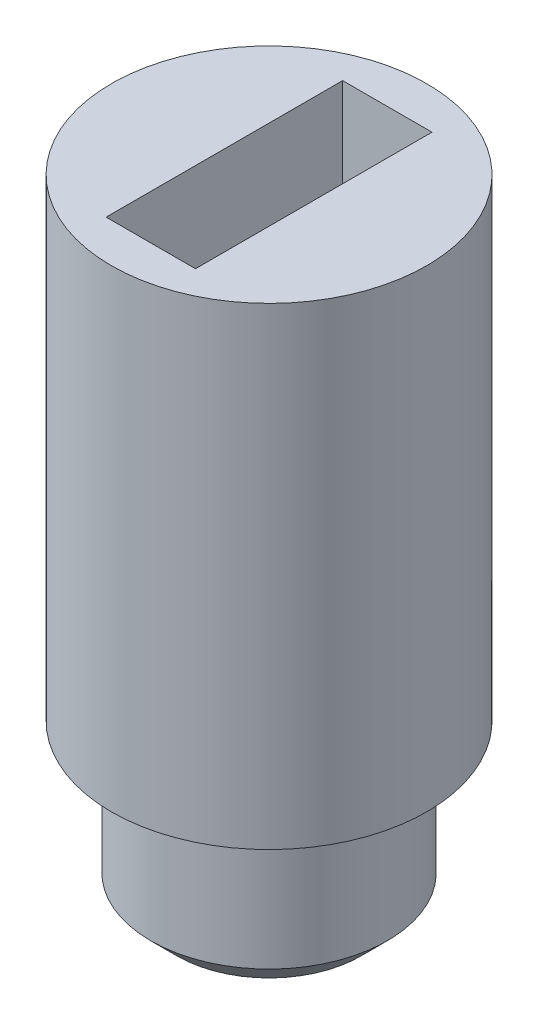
ISO-10303-21;
HEADER;
FILE_DESCRIPTION(('STEP AP214'),'2;1');
FILE_NAME('part.step','',(''),(''),'','','');
FILE_SCHEMA(('AUTOMOTIVE_DESIGN { 1 0 10303 214 1 1 1 1 }'));
ENDSEC;
DATA;
#1=APPLICATION_CONTEXT('core data for automotive mechanical design processes');
#2=APPLICATION_PROTOCOL_DEFINITION('international standard','automotive_design',2000,#1);
#3=PRODUCT_CONTEXT('',#1,'mechanical');
#4=PRODUCT('Part','Part','',(#3));
#5=PRODUCT_RELATED_PRODUCT_CATEGORY('part','',(#4));
#6=PRODUCT_DEFINITION_FORMATION('','',#4);
#7=PRODUCT_DEFINITION_CONTEXT('part definition',#1,'design');
#8=PRODUCT_DEFINITION('design','',#6,#7);
#9=PRODUCT_DEFINITION_SHAPE('','',#8);
#10=(LENGTH_UNIT() NAMED_UNIT(*) SI_UNIT(.MILLI.,.METRE.));
#11=(NAMED_UNIT(*) PLANE_ANGLE_UNIT() SI_UNIT($,.RADIAN.));
#12=(NAMED_UNIT(*) SI_UNIT($,.STERADIAN.) SOLID_ANGLE_UNIT());
#13=UNCERTAINTY_MEASURE_WITH_UNIT(LENGTH_MEASURE(1.E-05),#10,'distance_accuracy_value','');
#14=(GEOMETRIC_REPRESENTATION_CONTEXT(3) GLOBAL_UNCERTAINTY_ASSIGNED_CONTEXT((#13)) GLOBAL_UNIT_ASSIGNED_CONTEXT((#10,
#11,#12)) REPRESENTATION_CONTEXT('',''));
#15=CARTESIAN_POINT('',(0.,0.,0.));
#16=DIRECTION('',(0.,0.,1.));
#17=DIRECTION('',(1.,0.,0.));
#18=AXIS2_PLACEMENT_3D('',#15,#16,#17);
#19=CARTESIAN_POINT('',(0.,12.,0.));
#20=DIRECTION('',(0.,-1.,0.));
#21=DIRECTION('',(0.,0.,-1.));
#22=AXIS2_PLACEMENT_3D('',#19,#20,#21);
#23=PLANE('',#22);
#24=DIRECTION('',(-1.,0.,0.));
#25=VECTOR('',#24,1.);
#26=CARTESIAN_POINT('',(-0.85,12.,-2.25));
#27=LINE('',#26,#25);
#28=CARTESIAN_POINT('',(0.85,12.,-2.25));
#29=VERTEX_POINT('',#28);
#30=CARTESIAN_POINT('',(-0.85,12.,-2.25));
#31=VERTEX_POINT('',#30);
#32=EDGE_CURVE('E84',#29,#31,#27,.T.);
#33=ORIENTED_EDGE('',*,*,#32,.F.);
#34=DIRECTION('',(0.,0.,-1.));
#35=VECTOR('',#34,1.);
#36=CARTESIAN_POINT('',(0.85,12.,2.25));
#37=LINE('',#36,#35);
#38=CARTESIAN_POINT('',(0.85,12.,2.25));
#39=VERTEX_POINT('',#38);
#40=EDGE_CURVE('E49',#39,#29,#37,.T.);
#41=ORIENTED_EDGE('',*,*,#40,.F.);
#42=DIRECTION('',(1.,0.,0.));
#43=VECTOR('',#42,1.);
#44=CARTESIAN_POINT('',(-0.85,12.,2.25));
#45=LINE('',#44,#43);
#46=CARTESIAN_POINT('',(-0.85,12.,2.25));
#47=VERTEX_POINT('',#46);
#48=EDGE_CURVE('E100',#47,#39,#45,.T.);
#49=ORIENTED_EDGE('',*,*,#48,.F.);
#50=DIRECTION('',(0.,0.,1.));
#51=VECTOR('',#50,1.);
#52=CARTESIAN_POINT('',(-0.85,12.,2.25));
#53=LINE('',#52,#51);
#54=EDGE_CURVE('E106',#31,#47,#53,.T.);
#55=ORIENTED_EDGE('',*,*,#54,.F.);
#56=EDGE_LOOP('',(#33,#41,#49,#55));
#57=FACE_BOUND('',#56,.T.);
#58=CARTESIAN_POINT('',(0.,12.,0.));
#59=DIRECTION('',(0.,1.,0.));
#60=DIRECTION('',(0.,0.,1.));
#61=AXIS2_PLACEMENT_3D('',#58,#59,#60);
#62=CIRCLE('',#61,3.);
#63=CARTESIAN_POINT('',(0.,12.,3.));
#64=VERTEX_POINT('',#63);
#65=EDGE_CURVE('E118',#64,#64,#62,.T.);
#66=ORIENTED_EDGE('',*,*,#65,.T.);
#67=EDGE_LOOP('',(#66));
#68=FACE_BOUND('',#67,.T.);
#69=ADVANCED_FACE('F34',(#57,#68),#23,.F.);
#70=CARTESIAN_POINT('',(0.,0.,0.));
#71=DIRECTION('',(0.,1.,0.));
#72=DIRECTION('',(0.,0.,1.));
#73=AXIS2_PLACEMENT_3D('',#70,#71,#72);
#74=CYLINDRICAL_SURFACE('',#73,3.);
#75=ORIENTED_EDGE('',*,*,#65,.F.);
#76=EDGE_LOOP('',(#75));
#77=FACE_BOUND('',#76,.T.);
#78=CARTESIAN_POINT('',(0.,3.,0.));
#79=DIRECTION('',(0.,1.,0.));
#80=DIRECTION('',(0.,0.,1.));
#81=AXIS2_PLACEMENT_3D('',#78,#79,#80);
#82=CIRCLE('',#81,3.);
#83=CARTESIAN_POINT('',(0.,3.,3.));
#84=VERTEX_POINT('',#83);
#85=EDGE_CURVE('E115',#84,#84,#82,.T.);
#86=ORIENTED_EDGE('',*,*,#85,.T.);
#87=EDGE_LOOP('',(#86));
#88=FACE_BOUND('',#87,.T.);
#89=ADVANCED_FACE('F134',(#77,#88),#74,.T.);
#90=CARTESIAN_POINT('',(0.,3.,-3.));
#91=DIRECTION('',(0.,1.,0.));
#92=DIRECTION('',(0.,0.,1.));
#93=AXIS2_PLACEMENT_3D('',#90,#91,#92);
#94=PLANE('',#93);
#95=ORIENTED_EDGE('',*,*,#85,.F.);
#96=EDGE_LOOP('',(#95));
#97=FACE_BOUND('',#96,.T.);
#98=CARTESIAN_POINT('',(0.,3.,0.));
#99=DIRECTION('',(0.,1.,0.));
#100=DIRECTION('',(0.,0.,1.));
#101=AXIS2_PLACEMENT_3D('',#98,#99,#100);
#102=CIRCLE('',#101,2.25);
#103=CARTESIAN_POINT('',(0.,3.,2.25));
#104=VERTEX_POINT('',#103);
#105=EDGE_CURVE('E110',#104,#104,#102,.T.);
#106=ORIENTED_EDGE('',*,*,#105,.T.);
#107=EDGE_LOOP('',(#106));
#108=FACE_BOUND('',#107,.T.);
#109=ADVANCED_FACE('F139',(#97,#108),#94,.F.);
#110=CARTESIAN_POINT('',(0.,0.,0.));
#111=DIRECTION('',(0.,1.,0.));
#112=DIRECTION('',(0.,0.,1.));
#113=AXIS2_PLACEMENT_3D('',#110,#111,#112);
#114=CYLINDRICAL_SURFACE('',#113,2.25);
#115=CARTESIAN_POINT('',(0.,0.499999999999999,0.));
#116=DIRECTION('',(0.,1.,0.));
#117=DIRECTION('',(0.,0.,1.));
#118=AXIS2_PLACEMENT_3D('',#115,#116,#117);
#119=CIRCLE('',#118,2.25);
#120=CARTESIAN_POINT('',(0.,0.499999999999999,2.25));
#121=VERTEX_POINT('',#120);
#122=EDGE_CURVE('E42',#121,#121,#119,.T.);
#123=ORIENTED_EDGE('',*,*,#122,.T.);
#124=EDGE_LOOP('',(#123));
#125=FACE_BOUND('',#124,.T.);
#126=ORIENTED_EDGE('',*,*,#105,.F.);
#127=EDGE_LOOP('',(#126));
#128=FACE_BOUND('',#127,.T.);
#129=ADVANCED_FACE('F123',(#125,#128),#114,.T.);
#130=CARTESIAN_POINT('',(0.,0.,-2.25));
#131=DIRECTION('',(0.,1.,0.));
#132=DIRECTION('',(0.,0.,1.));
#133=AXIS2_PLACEMENT_3D('',#130,#131,#132);
#134=PLANE('',#133);
#135=CARTESIAN_POINT('',(0.,0.,0.));
#136=DIRECTION('',(0.,1.,0.));
#137=DIRECTION('',(0.,0.,1.));
#138=AXIS2_PLACEMENT_3D('',#135,#136,#137);
#139=CIRCLE('',#138,1.75);
#140=CARTESIAN_POINT('',(0.,0.,1.75));
#141=VERTEX_POINT('',#140);
#142=EDGE_CURVE('E11',#141,#141,#139,.F.);
#143=ORIENTED_EDGE('',*,*,#142,.T.);
#144=EDGE_LOOP('',(#143));
#145=FACE_BOUND('',#144,.T.);
#146=ADVANCED_FACE('F149',(#145),#134,.F.);
#147=CARTESIAN_POINT('',(0.85,10.,2.25));
#148=DIRECTION('',(1.,0.,0.));
#149=DIRECTION('',(0.,0.,-1.));
#150=AXIS2_PLACEMENT_3D('',#147,#148,#149);
#151=PLANE('',#150);
#152=ORIENTED_EDGE('',*,*,#40,.T.);
#153=DIRECTION('',(0.,1.,0.));
#154=VECTOR('',#153,1.);
#155=CARTESIAN_POINT('',(0.85,10.,-2.25));
#156=LINE('',#155,#154);
#157=CARTESIAN_POINT('',(0.85,10.,-2.25));
#158=VERTEX_POINT('',#157);
#159=EDGE_CURVE('E72',#158,#29,#156,.T.);
#160=ORIENTED_EDGE('',*,*,#159,.F.);
#161=DIRECTION('',(0.,0.,-1.));
#162=VECTOR('',#161,1.);
#163=CARTESIAN_POINT('',(0.85,10.,2.25));
#164=LINE('',#163,#162);
#165=CARTESIAN_POINT('',(0.85,10.,2.25));
#166=VERTEX_POINT('',#165);
#167=EDGE_CURVE('E98',#166,#158,#164,.T.);
#168=ORIENTED_EDGE('',*,*,#167,.F.);
#169=DIRECTION('',(0.,1.,0.));
#170=VECTOR('',#169,1.);
#171=CARTESIAN_POINT('',(0.85,10.,2.25));
#172=LINE('',#171,#170);
#173=EDGE_CURVE('E57',#166,#39,#172,.T.);
#174=ORIENTED_EDGE('',*,*,#173,.T.);
#175=EDGE_LOOP('',(#152,#160,#168,#174));
#176=FACE_BOUND('',#175,.T.);
#177=ADVANCED_FACE('F152',(#176),#151,.F.);
#178=CARTESIAN_POINT('',(-0.85,10.,2.25));
#179=DIRECTION('',(0.,0.,1.));
#180=DIRECTION('',(1.,0.,0.));
#181=AXIS2_PLACEMENT_3D('',#178,#179,#180);
#182=PLANE('',#181);
#183=ORIENTED_EDGE('',*,*,#48,.T.);
#184=ORIENTED_EDGE('',*,*,#173,.F.);
#185=DIRECTION('',(1.,0.,0.));
#186=VECTOR('',#185,1.);
#187=CARTESIAN_POINT('',(-0.85,10.,2.25));
#188=LINE('',#187,#186);
#189=CARTESIAN_POINT('',(-0.85,10.,2.25));
#190=VERTEX_POINT('',#189);
#191=EDGE_CURVE('E95',#190,#166,#188,.T.);
#192=ORIENTED_EDGE('',*,*,#191,.F.);
#193=DIRECTION('',(0.,1.,0.));
#194=VECTOR('',#193,1.);
#195=CARTESIAN_POINT('',(-0.85,10.,2.25));
#196=LINE('',#195,#194);
#197=EDGE_CURVE('E88',#190,#47,#196,.T.);
#198=ORIENTED_EDGE('',*,*,#197,.T.);
#199=EDGE_LOOP('',(#183,#184,#192,#198));
#200=FACE_BOUND('',#199,.T.);
#201=ADVANCED_FACE('F156',(#200),#182,.F.);
#202=CARTESIAN_POINT('',(-0.85,10.,2.25));
#203=DIRECTION('',(-1.,0.,0.));
#204=DIRECTION('',(0.,0.,1.));
#205=AXIS2_PLACEMENT_3D('',#202,#203,#204);
#206=PLANE('',#205);
#207=ORIENTED_EDGE('',*,*,#54,.T.);
#208=ORIENTED_EDGE('',*,*,#197,.F.);
#209=DIRECTION('',(0.,0.,1.));
#210=VECTOR('',#209,1.);
#211=CARTESIAN_POINT('',(-0.85,10.,2.25));
#212=LINE('',#211,#210);
#213=CARTESIAN_POINT('',(-0.85,10.,-2.25));
#214=VERTEX_POINT('',#213);
#215=EDGE_CURVE('E91',#214,#190,#212,.T.);
#216=ORIENTED_EDGE('',*,*,#215,.F.);
#217=DIRECTION('',(0.,1.,0.));
#218=VECTOR('',#217,1.);
#219=CARTESIAN_POINT('',(-0.85,10.,-2.25));
#220=LINE('',#219,#218);
#221=EDGE_CURVE('E77',#214,#31,#220,.T.);
#222=ORIENTED_EDGE('',*,*,#221,.T.);
#223=EDGE_LOOP('',(#207,#208,#216,#222));
#224=FACE_BOUND('',#223,.T.);
#225=ADVANCED_FACE('F92',(#224),#206,.F.);
#226=CARTESIAN_POINT('',(-0.85,10.,-2.25));
#227=DIRECTION('',(0.,0.,-1.));
#228=DIRECTION('',(-1.,0.,0.));
#229=AXIS2_PLACEMENT_3D('',#226,#227,#228);
#230=PLANE('',#229);
#231=ORIENTED_EDGE('',*,*,#32,.T.);
#232=ORIENTED_EDGE('',*,*,#221,.F.);
#233=DIRECTION('',(-1.,0.,0.));
#234=VECTOR('',#233,1.);
#235=CARTESIAN_POINT('',(-0.85,10.,-2.25));
#236=LINE('',#235,#234);
#237=EDGE_CURVE('E81',#158,#214,#236,.T.);
#238=ORIENTED_EDGE('',*,*,#237,.F.);
#239=ORIENTED_EDGE('',*,*,#159,.T.);
#240=EDGE_LOOP('',(#231,#232,#238,#239));
#241=FACE_BOUND('',#240,.T.);
#242=ADVANCED_FACE('F79',(#241),#230,.F.);
#243=CARTESIAN_POINT('',(0.,10.,0.));
#244=DIRECTION('',(0.,-1.,0.));
#245=DIRECTION('',(0.,0.,-1.));
#246=AXIS2_PLACEMENT_3D('',#243,#244,#245);
#247=PLANE('',#246);
#248=ORIENTED_EDGE('',*,*,#167,.T.);
#249=ORIENTED_EDGE('',*,*,#237,.T.);
#250=ORIENTED_EDGE('',*,*,#215,.T.);
#251=ORIENTED_EDGE('',*,*,#191,.T.);
#252=EDGE_LOOP('',(#248,#249,#250,#251));
#253=FACE_BOUND('',#252,.T.);
#254=ADVANCED_FACE('F97',(#253),#247,.F.);
#255=CARTESIAN_POINT('',(0.,0.499999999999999,0.));
#256=DIRECTION('',(0.,1.,0.));
#257=DIRECTION('',(0.,0.,1.));
#258=AXIS2_PLACEMENT_3D('',#255,#256,#257);
#259=CONICAL_SURFACE('',#258,2.25,0.785398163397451);
#260=ORIENTED_EDGE('',*,*,#142,.F.);
#261=EDGE_LOOP('',(#260));
#262=FACE_BOUND('',#261,.T.);
#263=ORIENTED_EDGE('',*,*,#122,.F.);
#264=EDGE_LOOP('',(#263));
#265=FACE_BOUND('',#264,.T.);
#266=ADVANCED_FACE('F36',(#262,#265),#259,.T.);
#267=CLOSED_SHELL('',(#69,#89,#109,#129,#146,#177,#201,#225,#242,#254,#266));
#268=MANIFOLD_SOLID_BREP('B2',#267);
#269=ADVANCED_BREP_SHAPE_REPRESENTATION('',(#18,#268),#14);
#270=SHAPE_DEFINITION_REPRESENTATION(#9,#269);
ENDSEC;
END-ISO-10303-21;
